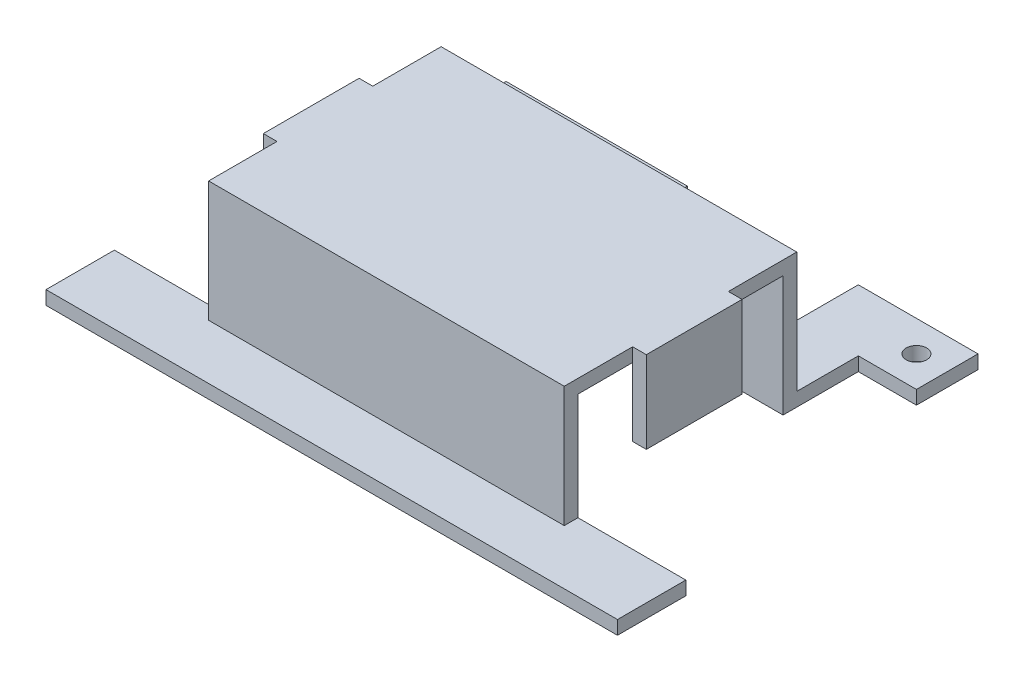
from build123d import *

# Parameters (mm, degrees)
SKETCH1_W            = 52
SKETCH1_H            = 34
BOSS_EXTRUDE1_DEPTH  = 19.65
SKETCH2_W            = 52
SKETCH2_H            = 30
CUT_EXTRUDE1_DEPTH   = 17.65
SKETCH3_W            = 9
SKETCH3_H            = 2
SKETCH3_W_2          = 18
BOSS_EXTRUDE2_DEPTH  = 18
SKETCH4_W            = 18
SKETCH4_H            = 2
BOSS_EXTRUDE3_DEPTH  = 8.5
SKETCH5_W            = 18
SKETCH5_H            = 2
BOSS_EXTRUDE4_DEPTH  = 8.5
SKETCH6_R            = 1.5
CUT_EXTRUDE2_DEPTH   = 82.705400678
SKETCH7_W            = 52
SKETCH7_H            = 2
BOSS_EXTRUDE5_DEPTH  = 8
SKETCH8_W            = 10
SKETCH8_H            = 2
BOSS_EXTRUDE6_DEPTH  = 15.78
SKETCH9_W            = 10
SKETCH9_H            = 2
BOSS_EXTRUDE7_DEPTH  = 15.78
SKETCH11_W           = 11
SKETCH11_H           = 17.65
CUT_EXTRUDE3_DEPTH   = 18
SKETCH12_W           = 9
SKETCH12_H           = 2
CUT_EXTRUDE4_DEPTH   = 8.5
SKETCH14_W           = 14
SKETCH14_H           = 2
BOSS_EXTRUDE8_DEPTH  = 2
SKETCH15_W           = 14
SKETCH15_H           = 2
BOSS_EXTRUDE9_DEPTH  = 2
SKETCH16_W           = 2
SKETCH16_H           = 14
BOSS_EXTRUDE10_DEPTH = 10


with BuildPart() as part:
    # Sketch1 → Boss-Extrude1 (new body)
    with BuildSketch(Plane(origin=(0, 0, 0), x_dir=(1, 0, 0), z_dir=(0, 1, 0))):
        with Locations((26, 17)):
            Rectangle(SKETCH1_W, SKETCH1_H)
    extrude(amount=BOSS_EXTRUDE1_DEPTH)

    # Sketch2 → Cut-Extrude1 (cut)
    with BuildSketch(Plane(origin=(0, 0, 0), x_dir=(-1, 0, 0), z_dir=(0, -1, 0))):
        with Locations((-26, 17)):
            Rectangle(SKETCH2_W, SKETCH2_H)
    extrude(amount=-CUT_EXTRUDE1_DEPTH, mode=Mode.SUBTRACT)

    # Sketch3 → Boss-Extrude2 (add)
    with BuildSketch(Plane(origin=(0, 0, -34), x_dir=(-1, 0, 0), z_dir=(0, 0, -1))):
        with Locations((-47.5, 1)):
            Rectangle(SKETCH3_W, SKETCH3_H)
        with Locations((-9, 1)):
            Rectangle(SKETCH3_W_2, SKETCH3_H)
    extrude(amount=BOSS_EXTRUDE2_DEPTH)

    # Sketch4 → Boss-Extrude3 (add)
    with BuildSketch(Plane(origin=(52, 0, 0), x_dir=(0, 0, -1), z_dir=(1, 0, 0))):
        with Locations((43, 1)):
            Rectangle(SKETCH4_W, SKETCH4_H)
    extrude(amount=BOSS_EXTRUDE3_DEPTH)

    # Sketch5 → Boss-Extrude4 (add)
    with BuildSketch(Plane.ZY):
        with Locations((-43, 1)):
            Rectangle(SKETCH5_W, SKETCH5_H)
    extrude(amount=BOSS_EXTRUDE4_DEPTH)

    # Sketch6 → Cut-Extrude2 (cut, through all)
    with BuildSketch(Plane(origin=(0, 2, 0), x_dir=(1, 0, 0), z_dir=(0, 1, 0))):
        with Locations(Location((56, 47.5, 0), (0, 0, 270))):
            Circle(SKETCH6_R)
        with Locations(Location((-4, 47.5, 0), (0, 0, 270))):
            Circle(SKETCH6_R)
    extrude(amount=-CUT_EXTRUDE2_DEPTH, mode=Mode.SUBTRACT)

    # Sketch7 → Boss-Extrude5 (add)
    with BuildSketch(Plane.XY):
        with Locations((26, 1)):
            Rectangle(SKETCH7_W, SKETCH7_H)
    extrude(amount=BOSS_EXTRUDE5_DEPTH)

    # Sketch8 → Boss-Extrude6 (add)
    with BuildSketch(Plane.ZY):
        with Locations((3, 1)):
            Rectangle(SKETCH8_W, SKETCH8_H)
    extrude(amount=BOSS_EXTRUDE6_DEPTH)

    # Sketch9 → Boss-Extrude7 (add)
    with BuildSketch(Plane(origin=(52, 0, 0), x_dir=(0, 0, -1), z_dir=(1, 0, 0))):
        with Locations((-3, 1)):
            Rectangle(SKETCH9_W, SKETCH9_H)
    extrude(amount=BOSS_EXTRUDE7_DEPTH)

    # Sketch11 → Cut-Extrude3 (cut)
    with BuildSketch(Plane.ZY.offset(8.5)):
        with Locations((-37.5, 8.825)):
            Rectangle(SKETCH11_W, SKETCH11_H)
    extrude(amount=-CUT_EXTRUDE3_DEPTH, mode=Mode.SUBTRACT)

    # Sketch12 → Cut-Extrude4 (cut)
    with BuildSketch(Plane(origin=(60.5, 0, 0), x_dir=(0, 0, -1), z_dir=(1, 0, 0))):
        with Locations((38.5, 1)):
            Rectangle(SKETCH12_W, SKETCH12_H)
    extrude(amount=-CUT_EXTRUDE4_DEPTH, mode=Mode.SUBTRACT)

    # Sketch14 → Boss-Extrude8 (add)
    with BuildSketch(Plane.ZY):
        with Locations((-17, 18.65)):
            Rectangle(SKETCH14_W, SKETCH14_H)
    extrude(amount=BOSS_EXTRUDE8_DEPTH)

    # Sketch15 → Boss-Extrude9 (add)
    with BuildSketch(Plane(origin=(52, 0, 0), x_dir=(0, 0, -1), z_dir=(1, 0, 0))):
        with Locations((17, 18.65)):
            Rectangle(SKETCH15_W, SKETCH15_H)
    extrude(amount=BOSS_EXTRUDE9_DEPTH)

    # Sketch16 → Boss-Extrude10 (add)
    with BuildSketch(Plane(origin=(0, 17.65, 0), x_dir=(-1, 0, 0), z_dir=(0, -1, 0))):
        with Locations((1, 17)):
            Rectangle(SKETCH16_W, SKETCH16_H)
        with Locations((-53, 17)):
            Rectangle(SKETCH16_W, SKETCH16_H)
    extrude(amount=BOSS_EXTRUDE10_DEPTH)


solid = part.part
